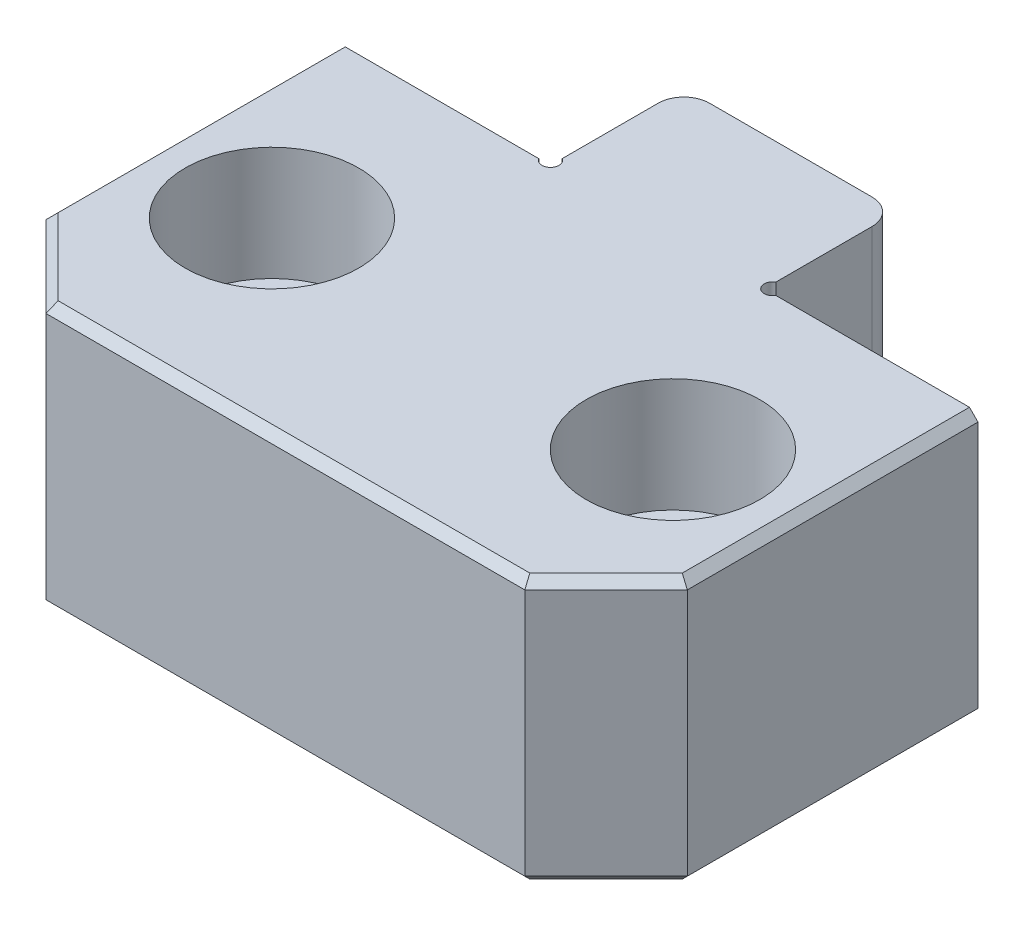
ISO-10303-21;
HEADER;
FILE_DESCRIPTION(('STEP AP214'),'2;1');
FILE_NAME('part.step','',(''),(''),'','','');
FILE_SCHEMA(('AUTOMOTIVE_DESIGN { 1 0 10303 214 1 1 1 1 }'));
ENDSEC;
DATA;
#1=APPLICATION_CONTEXT('core data for automotive mechanical design processes');
#2=APPLICATION_PROTOCOL_DEFINITION('international standard','automotive_design',2000,#1);
#3=PRODUCT_CONTEXT('',#1,'mechanical');
#4=PRODUCT('Part','Part','',(#3));
#5=PRODUCT_RELATED_PRODUCT_CATEGORY('part','',(#4));
#6=PRODUCT_DEFINITION_FORMATION('','',#4);
#7=PRODUCT_DEFINITION_CONTEXT('part definition',#1,'design');
#8=PRODUCT_DEFINITION('design','',#6,#7);
#9=PRODUCT_DEFINITION_SHAPE('','',#8);
#10=(LENGTH_UNIT() NAMED_UNIT(*) SI_UNIT(.MILLI.,.METRE.));
#11=(NAMED_UNIT(*) PLANE_ANGLE_UNIT() SI_UNIT($,.RADIAN.));
#12=(NAMED_UNIT(*) SI_UNIT($,.STERADIAN.) SOLID_ANGLE_UNIT());
#13=UNCERTAINTY_MEASURE_WITH_UNIT(LENGTH_MEASURE(1.E-05),#10,'distance_accuracy_value','');
#14=(GEOMETRIC_REPRESENTATION_CONTEXT(3) GLOBAL_UNCERTAINTY_ASSIGNED_CONTEXT((#13)) GLOBAL_UNIT_ASSIGNED_CONTEXT((#10,
#11,#12)) REPRESENTATION_CONTEXT('',''));
#15=CARTESIAN_POINT('',(0.,0.,0.));
#16=DIRECTION('',(0.,0.,1.));
#17=DIRECTION('',(1.,0.,0.));
#18=AXIS2_PLACEMENT_3D('',#15,#16,#17);
#19=CARTESIAN_POINT('',(-11.9126,15.748,10.9855));
#20=DIRECTION('',(0.,-1.,0.));
#21=DIRECTION('',(0.,0.,-1.));
#22=AXIS2_PLACEMENT_3D('',#19,#20,#21);
#23=CYLINDRICAL_SURFACE('',#22,3.5687);
#24=CARTESIAN_POINT('',(-11.9126,0.,10.9855));
#25=DIRECTION('',(0.,-1.,0.));
#26=DIRECTION('',(0.,0.,-1.));
#27=AXIS2_PLACEMENT_3D('',#24,#25,#26);
#28=CIRCLE('',#27,3.5687);
#29=CARTESIAN_POINT('',(-11.9126,0.,7.4168));
#30=VERTEX_POINT('',#29);
#31=EDGE_CURVE('E321',#30,#30,#28,.T.);
#32=ORIENTED_EDGE('',*,*,#31,.T.);
#33=EDGE_LOOP('',(#32));
#34=FACE_BOUND('',#33,.T.);
#35=CARTESIAN_POINT('',(-11.9126,8.9916,10.9855));
#36=DIRECTION('',(0.,1.,0.));
#37=DIRECTION('',(0.,0.,1.));
#38=AXIS2_PLACEMENT_3D('',#35,#36,#37);
#39=CIRCLE('',#38,3.5687);
#40=CARTESIAN_POINT('',(-11.9126,8.9916,14.5542));
#41=VERTEX_POINT('',#40);
#42=EDGE_CURVE('E335',#41,#41,#39,.F.);
#43=ORIENTED_EDGE('',*,*,#42,.F.);
#44=EDGE_LOOP('',(#43));
#45=FACE_BOUND('',#44,.T.);
#46=ADVANCED_FACE('F32',(#34,#45),#23,.F.);
#47=CARTESIAN_POINT('',(11.9126,15.748,10.9855));
#48=DIRECTION('',(0.,-1.,0.));
#49=DIRECTION('',(0.,0.,-1.));
#50=AXIS2_PLACEMENT_3D('',#47,#48,#49);
#51=CYLINDRICAL_SURFACE('',#50,3.5687);
#52=CARTESIAN_POINT('',(11.9126,0.,10.9855));
#53=DIRECTION('',(0.,-1.,0.));
#54=DIRECTION('',(0.,0.,-1.));
#55=AXIS2_PLACEMENT_3D('',#52,#53,#54);
#56=CIRCLE('',#55,3.5687);
#57=CARTESIAN_POINT('',(11.9126,0.,7.4168));
#58=VERTEX_POINT('',#57);
#59=EDGE_CURVE('E211',#58,#58,#56,.T.);
#60=ORIENTED_EDGE('',*,*,#59,.T.);
#61=EDGE_LOOP('',(#60));
#62=FACE_BOUND('',#61,.T.);
#63=CARTESIAN_POINT('',(11.9126,8.9916,10.9855));
#64=DIRECTION('',(0.,1.,0.));
#65=DIRECTION('',(0.,0.,1.));
#66=AXIS2_PLACEMENT_3D('',#63,#64,#65);
#67=CIRCLE('',#66,3.5687);
#68=CARTESIAN_POINT('',(11.9126,8.9916,14.5542));
#69=VERTEX_POINT('',#68);
#70=EDGE_CURVE('E325',#69,#69,#67,.F.);
#71=ORIENTED_EDGE('',*,*,#70,.F.);
#72=EDGE_LOOP('',(#71));
#73=FACE_BOUND('',#72,.T.);
#74=ADVANCED_FACE('F478',(#62,#73),#51,.F.);
#75=CARTESIAN_POINT('',(-19.05,15.748,22.098));
#76=DIRECTION('',(1.,0.,0.));
#77=DIRECTION('',(0.,0.,-1.));
#78=AXIS2_PLACEMENT_3D('',#75,#76,#77);
#79=PLANE('',#78);
#80=DIRECTION('',(0.,1.,0.));
#81=VECTOR('',#80,1.);
#82=CARTESIAN_POINT('',(-19.05,15.748,17.272));
#83=LINE('',#82,#81);
#84=CARTESIAN_POINT('',(-19.05,0.507999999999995,17.272));
#85=VERTEX_POINT('',#84);
#86=CARTESIAN_POINT('',(-19.05,15.24,17.272));
#87=VERTEX_POINT('',#86);
#88=EDGE_CURVE('E244',#85,#87,#83,.T.);
#89=ORIENTED_EDGE('',*,*,#88,.T.);
#90=DIRECTION('',(0.,0.,-1.));
#91=VECTOR('',#90,1.);
#92=CARTESIAN_POINT('',(-19.05,15.24,0.));
#93=LINE('',#92,#91);
#94=CARTESIAN_POINT('',(-19.05,15.24,0.));
#95=VERTEX_POINT('',#94);
#96=EDGE_CURVE('E275',#87,#95,#93,.T.);
#97=ORIENTED_EDGE('',*,*,#96,.T.);
#98=DIRECTION('',(0.,-1.,0.));
#99=VECTOR('',#98,1.);
#100=CARTESIAN_POINT('',(-19.05,15.748,0.));
#101=LINE('',#100,#99);
#102=CARTESIAN_POINT('',(-19.05,0.507999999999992,0.));
#103=VERTEX_POINT('',#102);
#104=EDGE_CURVE('E218',#95,#103,#101,.T.);
#105=ORIENTED_EDGE('',*,*,#104,.T.);
#106=DIRECTION('',(0.,0.,1.));
#107=VECTOR('',#106,1.);
#108=CARTESIAN_POINT('',(-19.05,0.507999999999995,22.098));
#109=LINE('',#108,#107);
#110=EDGE_CURVE('E272',#103,#85,#109,.T.);
#111=ORIENTED_EDGE('',*,*,#110,.T.);
#112=EDGE_LOOP('',(#89,#97,#105,#111));
#113=FACE_BOUND('',#112,.T.);
#114=ADVANCED_FACE('F462',(#113),#79,.F.);
#115=CARTESIAN_POINT('',(-19.05,15.748,22.098));
#116=DIRECTION('',(0.,0.,-1.));
#117=DIRECTION('',(-1.,0.,0.));
#118=AXIS2_PLACEMENT_3D('',#115,#116,#117);
#119=PLANE('',#118);
#120=DIRECTION('',(0.,1.,0.));
#121=VECTOR('',#120,1.);
#122=CARTESIAN_POINT('',(14.224,15.748,22.098));
#123=LINE('',#122,#121);
#124=CARTESIAN_POINT('',(14.224,0.507999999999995,22.098));
#125=VERTEX_POINT('',#124);
#126=CARTESIAN_POINT('',(14.224,15.24,22.098));
#127=VERTEX_POINT('',#126);
#128=EDGE_CURVE('E241',#125,#127,#123,.T.);
#129=ORIENTED_EDGE('',*,*,#128,.T.);
#130=DIRECTION('',(-1.,0.,0.));
#131=VECTOR('',#130,1.);
#132=CARTESIAN_POINT('',(-14.224,15.24,22.098));
#133=LINE('',#132,#131);
#134=CARTESIAN_POINT('',(-14.224,15.24,22.098));
#135=VERTEX_POINT('',#134);
#136=EDGE_CURVE('E299',#127,#135,#133,.T.);
#137=ORIENTED_EDGE('',*,*,#136,.T.);
#138=DIRECTION('',(0.,-1.,0.));
#139=VECTOR('',#138,1.);
#140=CARTESIAN_POINT('',(-14.224,15.748,22.098));
#141=LINE('',#140,#139);
#142=CARTESIAN_POINT('',(-14.224,0.507999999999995,22.098));
#143=VERTEX_POINT('',#142);
#144=EDGE_CURVE('E238',#135,#143,#141,.T.);
#145=ORIENTED_EDGE('',*,*,#144,.T.);
#146=DIRECTION('',(1.,0.,0.));
#147=VECTOR('',#146,1.);
#148=CARTESIAN_POINT('',(-19.05,0.507999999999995,22.098));
#149=LINE('',#148,#147);
#150=EDGE_CURVE('E297',#143,#125,#149,.T.);
#151=ORIENTED_EDGE('',*,*,#150,.T.);
#152=EDGE_LOOP('',(#129,#137,#145,#151));
#153=FACE_BOUND('',#152,.T.);
#154=ADVANCED_FACE('F466',(#153),#119,.F.);
#155=CARTESIAN_POINT('',(19.05,15.748,22.098));
#156=DIRECTION('',(-1.,0.,0.));
#157=DIRECTION('',(0.,0.,1.));
#158=AXIS2_PLACEMENT_3D('',#155,#156,#157);
#159=PLANE('',#158);
#160=DIRECTION('',(0.,-1.,0.));
#161=VECTOR('',#160,1.);
#162=CARTESIAN_POINT('',(19.05,15.748,0.));
#163=LINE('',#162,#161);
#164=CARTESIAN_POINT('',(19.05,15.24,0.));
#165=VERTEX_POINT('',#164);
#166=CARTESIAN_POINT('',(19.05,0.507999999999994,0.));
#167=VERTEX_POINT('',#166);
#168=EDGE_CURVE('E232',#165,#167,#163,.T.);
#169=ORIENTED_EDGE('',*,*,#168,.F.);
#170=DIRECTION('',(0.,0.,1.));
#171=VECTOR('',#170,1.);
#172=CARTESIAN_POINT('',(19.05,15.24,17.272));
#173=LINE('',#172,#171);
#174=CARTESIAN_POINT('',(19.05,15.24,17.272));
#175=VERTEX_POINT('',#174);
#176=EDGE_CURVE('E291',#165,#175,#173,.T.);
#177=ORIENTED_EDGE('',*,*,#176,.T.);
#178=DIRECTION('',(0.,-1.,0.));
#179=VECTOR('',#178,1.);
#180=CARTESIAN_POINT('',(19.05,15.748,17.272));
#181=LINE('',#180,#179);
#182=CARTESIAN_POINT('',(19.05,0.507999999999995,17.272));
#183=VERTEX_POINT('',#182);
#184=EDGE_CURVE('E235',#175,#183,#181,.T.);
#185=ORIENTED_EDGE('',*,*,#184,.T.);
#186=DIRECTION('',(0.,0.,-1.));
#187=VECTOR('',#186,1.);
#188=CARTESIAN_POINT('',(19.05,0.507999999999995,22.098));
#189=LINE('',#188,#187);
#190=EDGE_CURVE('E289',#183,#167,#189,.T.);
#191=ORIENTED_EDGE('',*,*,#190,.T.);
#192=EDGE_LOOP('',(#169,#177,#185,#191));
#193=FACE_BOUND('',#192,.T.);
#194=ADVANCED_FACE('F408',(#193),#159,.F.);
#195=CARTESIAN_POINT('',(7.0439409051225,15.748,0.));
#196=DIRECTION('',(0.,0.,1.));
#197=DIRECTION('',(1.,0.,0.));
#198=AXIS2_PLACEMENT_3D('',#195,#196,#197);
#199=PLANE('',#198);
#200=DIRECTION('',(-1.,0.,0.));
#201=VECTOR('',#200,1.);
#202=CARTESIAN_POINT('',(7.0439409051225,15.748,0.));
#203=LINE('',#202,#201);
#204=CARTESIAN_POINT('',(18.542,15.748,0.));
#205=VERTEX_POINT('',#204);
#206=CARTESIAN_POINT('',(7.0439409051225,15.748,0.));
#207=VERTEX_POINT('',#206);
#208=EDGE_CURVE('E217',#205,#207,#203,.T.);
#209=ORIENTED_EDGE('',*,*,#208,.F.);
#210=DIRECTION('',(0.707106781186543,-0.707106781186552,0.));
#211=VECTOR('',#210,1.);
#212=CARTESIAN_POINT('',(18.542,15.748,0.));
#213=LINE('',#212,#211);
#214=EDGE_CURVE('E287',#205,#165,#213,.T.);
#215=ORIENTED_EDGE('',*,*,#214,.T.);
#216=ORIENTED_EDGE('',*,*,#168,.T.);
#217=DIRECTION('',(0.707106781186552,0.707106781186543,0.));
#218=VECTOR('',#217,1.);
#219=CARTESIAN_POINT('',(19.05,0.507999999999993,0.));
#220=LINE('',#219,#218);
#221=CARTESIAN_POINT('',(18.542,0.,0.));
#222=VERTEX_POINT('',#221);
#223=EDGE_CURVE('E285',#167,#222,#220,.F.);
#224=ORIENTED_EDGE('',*,*,#223,.T.);
#225=DIRECTION('',(-1.,0.,0.));
#226=VECTOR('',#225,1.);
#227=CARTESIAN_POINT('',(7.0439409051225,0.,0.));
#228=LINE('',#227,#226);
#229=CARTESIAN_POINT('',(7.0439409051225,0.,0.));
#230=VERTEX_POINT('',#229);
#231=EDGE_CURVE('E207',#222,#230,#228,.T.);
#232=ORIENTED_EDGE('',*,*,#231,.T.);
#233=DIRECTION('',(0.,-1.,0.));
#234=VECTOR('',#233,1.);
#235=CARTESIAN_POINT('',(7.0439409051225,15.748,0.));
#236=LINE('',#235,#234);
#237=EDGE_CURVE('E206',#207,#230,#236,.T.);
#238=ORIENTED_EDGE('',*,*,#237,.F.);
#239=EDGE_LOOP('',(#209,#215,#216,#224,#232,#238));
#240=FACE_BOUND('',#239,.T.);
#241=ADVANCED_FACE('F405',(#240),#199,.F.);
#242=CARTESIAN_POINT('',(6.604,15.748,-0.254));
#243=DIRECTION('',(0.,-1.,0.));
#244=DIRECTION('',(0.,0.,-1.));
#245=AXIS2_PLACEMENT_3D('',#242,#243,#244);
#246=CYLINDRICAL_SURFACE('',#245,0.508);
#247=CARTESIAN_POINT('',(6.604,0.,-0.254));
#248=DIRECTION('',(0.,-1.,0.));
#249=DIRECTION('',(0.,0.,1.));
#250=AXIS2_PLACEMENT_3D('',#247,#248,#249);
#251=CIRCLE('',#250,0.508);
#252=CARTESIAN_POINT('',(6.16405909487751,0.,0.));
#253=VERTEX_POINT('',#252);
#254=EDGE_CURVE('E197',#230,#253,#251,.T.);
#255=ORIENTED_EDGE('',*,*,#254,.T.);
#256=DIRECTION('',(0.,-1.,0.));
#257=VECTOR('',#256,1.);
#258=CARTESIAN_POINT('',(6.16405909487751,15.748,0.));
#259=LINE('',#258,#257);
#260=CARTESIAN_POINT('',(6.16405909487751,0.254000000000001,0.));
#261=VERTEX_POINT('',#260);
#262=EDGE_CURVE('E180',#253,#261,#259,.F.);
#263=ORIENTED_EDGE('',*,*,#262,.T.);
#264=CARTESIAN_POINT('',(6.604,0.254000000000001,-0.254));
#265=DIRECTION('',(0.,1.,0.));
#266=DIRECTION('',(0.,0.,1.));
#267=AXIS2_PLACEMENT_3D('',#264,#265,#266);
#268=CIRCLE('',#267,0.508);
#269=CARTESIAN_POINT('',(6.35,0.254,-0.693940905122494));
#270=VERTEX_POINT('',#269);
#271=EDGE_CURVE('E564',#261,#270,#268,.F.);
#272=ORIENTED_EDGE('',*,*,#271,.T.);
#273=DIRECTION('',(0.,-1.,0.));
#274=VECTOR('',#273,1.);
#275=CARTESIAN_POINT('',(6.35,15.748,-0.693940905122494));
#276=LINE('',#275,#274);
#277=CARTESIAN_POINT('',(6.35,15.748,-0.693940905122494));
#278=VERTEX_POINT('',#277);
#279=EDGE_CURVE('E228',#278,#270,#276,.T.);
#280=ORIENTED_EDGE('',*,*,#279,.F.);
#281=CARTESIAN_POINT('',(6.604,15.748,-0.254));
#282=DIRECTION('',(0.,-1.,0.));
#283=DIRECTION('',(0.,0.,1.));
#284=AXIS2_PLACEMENT_3D('',#281,#282,#283);
#285=CIRCLE('',#284,0.508);
#286=EDGE_CURVE('E358',#207,#278,#285,.T.);
#287=ORIENTED_EDGE('',*,*,#286,.F.);
#288=ORIENTED_EDGE('',*,*,#237,.T.);
#289=EDGE_LOOP('',(#255,#263,#272,#280,#287,#288));
#290=FACE_BOUND('',#289,.T.);
#291=ADVANCED_FACE('F203',(#290),#246,.F.);
#292=CARTESIAN_POINT('',(6.35,15.748,-7.9248));
#293=DIRECTION('',(-1.,0.,0.));
#294=DIRECTION('',(0.,0.,1.));
#295=AXIS2_PLACEMENT_3D('',#292,#293,#294);
#296=PLANE('',#295);
#297=ORIENTED_EDGE('',*,*,#279,.T.);
#298=DIRECTION('',(0.,0.,1.));
#299=VECTOR('',#298,1.);
#300=CARTESIAN_POINT('',(6.35,0.254,0.));
#301=LINE('',#300,#299);
#302=CARTESIAN_POINT('',(6.35,0.254000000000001,-6.4008));
#303=VERTEX_POINT('',#302);
#304=EDGE_CURVE('E200',#303,#270,#301,.T.);
#305=ORIENTED_EDGE('',*,*,#304,.F.);
#306=DIRECTION('',(0.,-1.,0.));
#307=VECTOR('',#306,1.);
#308=CARTESIAN_POINT('',(6.35,15.748,-6.4008));
#309=LINE('',#308,#307);
#310=CARTESIAN_POINT('',(6.35,15.748,-6.4008));
#311=VERTEX_POINT('',#310);
#312=EDGE_CURVE('E259',#303,#311,#309,.F.);
#313=ORIENTED_EDGE('',*,*,#312,.T.);
#314=DIRECTION('',(0.,0.,-1.));
#315=VECTOR('',#314,1.);
#316=CARTESIAN_POINT('',(6.35,15.748,-7.9248));
#317=LINE('',#316,#315);
#318=EDGE_CURVE('E360',#278,#311,#317,.T.);
#319=ORIENTED_EDGE('',*,*,#318,.F.);
#320=EDGE_LOOP('',(#297,#305,#313,#319));
#321=FACE_BOUND('',#320,.T.);
#322=ADVANCED_FACE('F506',(#321),#296,.F.);
#323=CARTESIAN_POINT('',(-6.35,15.748,-7.9248));
#324=DIRECTION('',(0.,0.,1.));
#325=DIRECTION('',(1.,0.,0.));
#326=AXIS2_PLACEMENT_3D('',#323,#324,#325);
#327=PLANE('',#326);
#328=DIRECTION('',(0.,-1.,0.));
#329=VECTOR('',#328,1.);
#330=CARTESIAN_POINT('',(4.826,15.748,-7.9248));
#331=LINE('',#330,#329);
#332=CARTESIAN_POINT('',(4.826,15.748,-7.9248));
#333=VERTEX_POINT('',#332);
#334=CARTESIAN_POINT('',(4.826,0.254000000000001,-7.9248));
#335=VERTEX_POINT('',#334);
#336=EDGE_CURVE('E250',#333,#335,#331,.T.);
#337=ORIENTED_EDGE('',*,*,#336,.T.);
#338=DIRECTION('',(1.,0.,0.));
#339=VECTOR('',#338,1.);
#340=CARTESIAN_POINT('',(6.35,0.254,-7.9248));
#341=LINE('',#340,#339);
#342=CARTESIAN_POINT('',(-4.826,0.254000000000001,-7.9248));
#343=VERTEX_POINT('',#342);
#344=EDGE_CURVE('E46',#343,#335,#341,.T.);
#345=ORIENTED_EDGE('',*,*,#344,.F.);
#346=DIRECTION('',(0.,-1.,0.));
#347=VECTOR('',#346,1.);
#348=CARTESIAN_POINT('',(-4.826,15.748,-7.9248));
#349=LINE('',#348,#347);
#350=CARTESIAN_POINT('',(-4.826,15.748,-7.9248));
#351=VERTEX_POINT('',#350);
#352=EDGE_CURVE('E253',#343,#351,#349,.F.);
#353=ORIENTED_EDGE('',*,*,#352,.T.);
#354=DIRECTION('',(-1.,0.,0.));
#355=VECTOR('',#354,1.);
#356=CARTESIAN_POINT('',(-6.35,15.748,-7.9248));
#357=LINE('',#356,#355);
#358=EDGE_CURVE('E363',#333,#351,#357,.T.);
#359=ORIENTED_EDGE('',*,*,#358,.F.);
#360=EDGE_LOOP('',(#337,#345,#353,#359));
#361=FACE_BOUND('',#360,.T.);
#362=ADVANCED_FACE('F431',(#361),#327,.F.);
#363=CARTESIAN_POINT('',(-6.35,15.748,-0.693940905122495));
#364=DIRECTION('',(1.,0.,0.));
#365=DIRECTION('',(0.,0.,-1.));
#366=AXIS2_PLACEMENT_3D('',#363,#364,#365);
#367=PLANE('',#366);
#368=DIRECTION('',(0.,-1.,0.));
#369=VECTOR('',#368,1.);
#370=CARTESIAN_POINT('',(-6.35,15.748,-6.4008));
#371=LINE('',#370,#369);
#372=CARTESIAN_POINT('',(-6.35,15.748,-6.4008));
#373=VERTEX_POINT('',#372);
#374=CARTESIAN_POINT('',(-6.35,0.254000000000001,-6.4008));
#375=VERTEX_POINT('',#374);
#376=EDGE_CURVE('E247',#373,#375,#371,.T.);
#377=ORIENTED_EDGE('',*,*,#376,.T.);
#378=DIRECTION('',(0.,0.,-1.));
#379=VECTOR('',#378,1.);
#380=CARTESIAN_POINT('',(-6.35,0.254,-7.9248));
#381=LINE('',#380,#379);
#382=CARTESIAN_POINT('',(-6.35,0.254000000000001,-0.693940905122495));
#383=VERTEX_POINT('',#382);
#384=EDGE_CURVE('E444',#383,#375,#381,.T.);
#385=ORIENTED_EDGE('',*,*,#384,.F.);
#386=DIRECTION('',(0.,-1.,0.));
#387=VECTOR('',#386,1.);
#388=CARTESIAN_POINT('',(-6.35,15.748,-0.693940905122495));
#389=LINE('',#388,#387);
#390=CARTESIAN_POINT('',(-6.35,15.748,-0.693940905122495));
#391=VERTEX_POINT('',#390);
#392=EDGE_CURVE('E225',#391,#383,#389,.T.);
#393=ORIENTED_EDGE('',*,*,#392,.F.);
#394=DIRECTION('',(0.,0.,1.));
#395=VECTOR('',#394,1.);
#396=CARTESIAN_POINT('',(-6.35,15.748,-0.693940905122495));
#397=LINE('',#396,#395);
#398=EDGE_CURVE('E366',#373,#391,#397,.T.);
#399=ORIENTED_EDGE('',*,*,#398,.F.);
#400=EDGE_LOOP('',(#377,#385,#393,#399));
#401=FACE_BOUND('',#400,.T.);
#402=ADVANCED_FACE('F442',(#401),#367,.F.);
#403=CARTESIAN_POINT('',(-6.604,15.748,-0.254));
#404=DIRECTION('',(0.,-1.,0.));
#405=DIRECTION('',(0.,0.,-1.));
#406=AXIS2_PLACEMENT_3D('',#403,#404,#405);
#407=CYLINDRICAL_SURFACE('',#406,0.508);
#408=CARTESIAN_POINT('',(-6.604,0.254000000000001,-0.254));
#409=DIRECTION('',(0.,1.,0.));
#410=DIRECTION('',(0.,0.,1.));
#411=AXIS2_PLACEMENT_3D('',#408,#409,#410);
#412=CIRCLE('',#411,0.508);
#413=CARTESIAN_POINT('',(-6.1640590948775,0.254000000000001,0.));
#414=VERTEX_POINT('',#413);
#415=EDGE_CURVE('E563',#383,#414,#412,.F.);
#416=ORIENTED_EDGE('',*,*,#415,.T.);
#417=DIRECTION('',(0.,-1.,0.));
#418=VECTOR('',#417,1.);
#419=CARTESIAN_POINT('',(-6.1640590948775,15.748,0.));
#420=LINE('',#419,#418);
#421=CARTESIAN_POINT('',(-6.1640590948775,0.,0.));
#422=VERTEX_POINT('',#421);
#423=EDGE_CURVE('E191',#414,#422,#420,.T.);
#424=ORIENTED_EDGE('',*,*,#423,.T.);
#425=CARTESIAN_POINT('',(-6.604,0.,-0.254));
#426=DIRECTION('',(0.,-1.,0.));
#427=DIRECTION('',(0.,0.,1.));
#428=AXIS2_PLACEMENT_3D('',#425,#426,#427);
#429=CIRCLE('',#428,0.508);
#430=CARTESIAN_POINT('',(-7.04394090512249,0.,0.));
#431=VERTEX_POINT('',#430);
#432=EDGE_CURVE('E199',#422,#431,#429,.T.);
#433=ORIENTED_EDGE('',*,*,#432,.T.);
#434=DIRECTION('',(0.,-1.,0.));
#435=VECTOR('',#434,1.);
#436=CARTESIAN_POINT('',(-7.04394090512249,15.748,0.));
#437=LINE('',#436,#435);
#438=CARTESIAN_POINT('',(-7.04394090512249,15.748,0.));
#439=VERTEX_POINT('',#438);
#440=EDGE_CURVE('E221',#439,#431,#437,.T.);
#441=ORIENTED_EDGE('',*,*,#440,.F.);
#442=CARTESIAN_POINT('',(-6.604,15.748,-0.254));
#443=DIRECTION('',(0.,-1.,0.));
#444=DIRECTION('',(0.,0.,1.));
#445=AXIS2_PLACEMENT_3D('',#442,#443,#444);
#446=CIRCLE('',#445,0.508);
#447=EDGE_CURVE('E368',#391,#439,#446,.T.);
#448=ORIENTED_EDGE('',*,*,#447,.F.);
#449=ORIENTED_EDGE('',*,*,#392,.T.);
#450=EDGE_LOOP('',(#416,#424,#433,#441,#448,#449));
#451=FACE_BOUND('',#450,.T.);
#452=ADVANCED_FACE('F447',(#451),#407,.F.);
#453=CARTESIAN_POINT('',(-19.05,15.748,0.));
#454=DIRECTION('',(0.,0.,1.));
#455=DIRECTION('',(1.,0.,0.));
#456=AXIS2_PLACEMENT_3D('',#453,#454,#455);
#457=PLANE('',#456);
#458=ORIENTED_EDGE('',*,*,#104,.F.);
#459=DIRECTION('',(0.707106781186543,0.707106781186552,0.));
#460=VECTOR('',#459,1.);
#461=CARTESIAN_POINT('',(-18.542,15.748,0.));
#462=LINE('',#461,#460);
#463=CARTESIAN_POINT('',(-18.542,15.748,0.));
#464=VERTEX_POINT('',#463);
#465=EDGE_CURVE('E279',#95,#464,#462,.T.);
#466=ORIENTED_EDGE('',*,*,#465,.T.);
#467=DIRECTION('',(-1.,0.,0.));
#468=VECTOR('',#467,1.);
#469=CARTESIAN_POINT('',(-19.05,15.748,0.));
#470=LINE('',#469,#468);
#471=EDGE_CURVE('E222',#439,#464,#470,.T.);
#472=ORIENTED_EDGE('',*,*,#471,.F.);
#473=ORIENTED_EDGE('',*,*,#440,.T.);
#474=DIRECTION('',(-1.,0.,0.));
#475=VECTOR('',#474,1.);
#476=CARTESIAN_POINT('',(-19.05,0.,0.));
#477=LINE('',#476,#475);
#478=CARTESIAN_POINT('',(-18.542,0.,0.));
#479=VERTEX_POINT('',#478);
#480=EDGE_CURVE('E209',#431,#479,#477,.T.);
#481=ORIENTED_EDGE('',*,*,#480,.T.);
#482=DIRECTION('',(0.707106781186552,-0.707106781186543,0.));
#483=VECTOR('',#482,1.);
#484=CARTESIAN_POINT('',(-19.05,0.507999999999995,0.));
#485=LINE('',#484,#483);
#486=EDGE_CURVE('E277',#479,#103,#485,.F.);
#487=ORIENTED_EDGE('',*,*,#486,.T.);
#488=EDGE_LOOP('',(#458,#466,#472,#473,#481,#487));
#489=FACE_BOUND('',#488,.T.);
#490=ADVANCED_FACE('F449',(#489),#457,.F.);
#491=CARTESIAN_POINT('',(-6.604,15.748,-0.254));
#492=DIRECTION('',(0.,1.,0.));
#493=DIRECTION('',(0.,0.,1.));
#494=AXIS2_PLACEMENT_3D('',#491,#492,#493);
#495=PLANE('',#494);
#496=CARTESIAN_POINT('',(-11.9126,15.748,10.9855));
#497=DIRECTION('',(0.,1.,0.));
#498=DIRECTION('',(0.,0.,1.));
#499=AXIS2_PLACEMENT_3D('',#496,#497,#498);
#500=CIRCLE('',#499,5.1562);
#501=CARTESIAN_POINT('',(-11.9126,15.748,16.1417));
#502=VERTEX_POINT('',#501);
#503=EDGE_CURVE('E190',#502,#502,#500,.T.);
#504=ORIENTED_EDGE('',*,*,#503,.F.);
#505=EDGE_LOOP('',(#504));
#506=FACE_BOUND('',#505,.T.);
#507=CARTESIAN_POINT('',(11.9126,15.748,10.9855));
#508=DIRECTION('',(0.,1.,0.));
#509=DIRECTION('',(0.,0.,1.));
#510=AXIS2_PLACEMENT_3D('',#507,#508,#509);
#511=CIRCLE('',#510,5.1562);
#512=CARTESIAN_POINT('',(11.9126,15.748,16.1417));
#513=VERTEX_POINT('',#512);
#514=EDGE_CURVE('E337',#513,#513,#511,.T.);
#515=ORIENTED_EDGE('',*,*,#514,.F.);
#516=EDGE_LOOP('',(#515));
#517=FACE_BOUND('',#516,.T.);
#518=ORIENTED_EDGE('',*,*,#471,.T.);
#519=DIRECTION('',(0.,0.,1.));
#520=VECTOR('',#519,1.);
#521=CARTESIAN_POINT('',(-18.542,15.748,17.272));
#522=LINE('',#521,#520);
#523=CARTESIAN_POINT('',(-18.542,15.748,17.0615795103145));
#524=VERTEX_POINT('',#523);
#525=EDGE_CURVE('E269',#464,#524,#522,.T.);
#526=ORIENTED_EDGE('',*,*,#525,.T.);
#527=DIRECTION('',(0.707106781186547,0.,0.707106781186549));
#528=VECTOR('',#527,1.);
#529=CARTESIAN_POINT('',(-21.2307897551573,15.748,14.3727897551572));
#530=LINE('',#529,#528);
#531=CARTESIAN_POINT('',(-14.0135795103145,15.748,21.59));
#532=VERTEX_POINT('',#531);
#533=EDGE_CURVE('E267',#524,#532,#530,.T.);
#534=ORIENTED_EDGE('',*,*,#533,.T.);
#535=DIRECTION('',(1.,0.,0.));
#536=VECTOR('',#535,1.);
#537=CARTESIAN_POINT('',(14.224,15.748,21.59));
#538=LINE('',#537,#536);
#539=CARTESIAN_POINT('',(14.0135795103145,15.748,21.59));
#540=VERTEX_POINT('',#539);
#541=EDGE_CURVE('E261',#532,#540,#538,.T.);
#542=ORIENTED_EDGE('',*,*,#541,.T.);
#543=DIRECTION('',(0.707106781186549,0.,-0.707106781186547));
#544=VECTOR('',#543,1.);
#545=CARTESIAN_POINT('',(14.6267897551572,15.748,20.9767897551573));
#546=LINE('',#545,#544);
#547=CARTESIAN_POINT('',(18.542,15.748,17.0615795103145));
#548=VERTEX_POINT('',#547);
#549=EDGE_CURVE('E263',#540,#548,#546,.T.);
#550=ORIENTED_EDGE('',*,*,#549,.T.);
#551=DIRECTION('',(0.,0.,-1.));
#552=VECTOR('',#551,1.);
#553=CARTESIAN_POINT('',(18.542,15.748,0.));
#554=LINE('',#553,#552);
#555=EDGE_CURVE('E265',#548,#205,#554,.T.);
#556=ORIENTED_EDGE('',*,*,#555,.T.);
#557=ORIENTED_EDGE('',*,*,#208,.T.);
#558=ORIENTED_EDGE('',*,*,#286,.T.);
#559=ORIENTED_EDGE('',*,*,#318,.T.);
#560=CARTESIAN_POINT('',(4.826,15.748,-6.4008));
#561=DIRECTION('',(0.,1.,0.));
#562=DIRECTION('',(0.,0.,1.));
#563=AXIS2_PLACEMENT_3D('',#560,#561,#562);
#564=CIRCLE('',#563,1.524);
#565=EDGE_CURVE('E255',#311,#333,#564,.T.);
#566=ORIENTED_EDGE('',*,*,#565,.T.);
#567=ORIENTED_EDGE('',*,*,#358,.T.);
#568=CARTESIAN_POINT('',(-4.826,15.748,-6.4008));
#569=DIRECTION('',(0.,1.,0.));
#570=DIRECTION('',(0.,0.,1.));
#571=AXIS2_PLACEMENT_3D('',#568,#569,#570);
#572=CIRCLE('',#571,1.524);
#573=EDGE_CURVE('E257',#351,#373,#572,.T.);
#574=ORIENTED_EDGE('',*,*,#573,.T.);
#575=ORIENTED_EDGE('',*,*,#398,.T.);
#576=ORIENTED_EDGE('',*,*,#447,.T.);
#577=EDGE_LOOP('',(#518,#526,#534,#542,#550,#556,#557,#558,#559,#566,#567,#574,#575,#576));
#578=FACE_BOUND('',#577,.T.);
#579=ADVANCED_FACE('F373',(#506,#517,#578),#495,.T.);
#580=CARTESIAN_POINT('',(-6.604,0.,-0.254));
#581=DIRECTION('',(0.,1.,0.));
#582=DIRECTION('',(0.,0.,1.));
#583=AXIS2_PLACEMENT_3D('',#580,#581,#582);
#584=PLANE('',#583);
#585=ORIENTED_EDGE('',*,*,#31,.F.);
#586=EDGE_LOOP('',(#585));
#587=FACE_BOUND('',#586,.T.);
#588=ORIENTED_EDGE('',*,*,#59,.F.);
#589=EDGE_LOOP('',(#588));
#590=FACE_BOUND('',#589,.T.);
#591=ORIENTED_EDGE('',*,*,#432,.F.);
#592=DIRECTION('',(-1.,0.,0.));
#593=VECTOR('',#592,1.);
#594=CARTESIAN_POINT('',(6.35,0.,0.));
#595=LINE('',#594,#593);
#596=EDGE_CURVE('E183',#253,#422,#595,.T.);
#597=ORIENTED_EDGE('',*,*,#596,.F.);
#598=ORIENTED_EDGE('',*,*,#254,.F.);
#599=ORIENTED_EDGE('',*,*,#231,.F.);
#600=DIRECTION('',(0.,0.,1.));
#601=VECTOR('',#600,1.);
#602=CARTESIAN_POINT('',(18.542,0.,-0.253999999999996));
#603=LINE('',#602,#601);
#604=CARTESIAN_POINT('',(18.542,0.,17.0615795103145));
#605=VERTEX_POINT('',#604);
#606=EDGE_CURVE('E301',#222,#605,#603,.T.);
#607=ORIENTED_EDGE('',*,*,#606,.T.);
#608=DIRECTION('',(-0.707106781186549,0.,0.707106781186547));
#609=VECTOR('',#608,1.);
#610=CARTESIAN_POINT('',(13.8647897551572,0.,21.7387897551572));
#611=LINE('',#610,#609);
#612=CARTESIAN_POINT('',(14.0135795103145,0.,21.59));
#613=VERTEX_POINT('',#612);
#614=EDGE_CURVE('E303',#605,#613,#611,.T.);
#615=ORIENTED_EDGE('',*,*,#614,.T.);
#616=DIRECTION('',(-1.,0.,0.));
#617=VECTOR('',#616,1.);
#618=CARTESIAN_POINT('',(-6.604,0.,21.59));
#619=LINE('',#618,#617);
#620=CARTESIAN_POINT('',(-14.0135795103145,0.,21.59));
#621=VERTEX_POINT('',#620);
#622=EDGE_CURVE('E305',#613,#621,#619,.T.);
#623=ORIENTED_EDGE('',*,*,#622,.T.);
#624=DIRECTION('',(-0.707106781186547,0.,-0.707106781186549));
#625=VECTOR('',#624,1.);
#626=CARTESIAN_POINT('',(-18.6907897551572,0.,16.9127897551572));
#627=LINE('',#626,#625);
#628=CARTESIAN_POINT('',(-18.542,0.,17.0615795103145));
#629=VERTEX_POINT('',#628);
#630=EDGE_CURVE('E54',#621,#629,#627,.T.);
#631=ORIENTED_EDGE('',*,*,#630,.T.);
#632=DIRECTION('',(0.,0.,-1.));
#633=VECTOR('',#632,1.);
#634=CARTESIAN_POINT('',(-18.542,0.,-0.254));
#635=LINE('',#634,#633);
#636=EDGE_CURVE('E40',#629,#479,#635,.T.);
#637=ORIENTED_EDGE('',*,*,#636,.T.);
#638=ORIENTED_EDGE('',*,*,#480,.F.);
#639=EDGE_LOOP('',(#591,#597,#598,#599,#607,#615,#623,#631,#637,#638));
#640=FACE_BOUND('',#639,.T.);
#641=ADVANCED_FACE('F195',(#587,#590,#640),#584,.F.);
#642=CARTESIAN_POINT('',(19.05,15.748,17.272));
#643=DIRECTION('',(-0.707106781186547,0.,-0.707106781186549));
#644=DIRECTION('',(-0.707106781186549,0.,0.707106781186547));
#645=AXIS2_PLACEMENT_3D('',#642,#643,#644);
#646=PLANE('',#645);
#647=ORIENTED_EDGE('',*,*,#184,.F.);
#648=DIRECTION('',(0.707106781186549,0.,-0.707106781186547));
#649=VECTOR('',#648,1.);
#650=CARTESIAN_POINT('',(19.05,15.24,17.272));
#651=LINE('',#650,#649);
#652=EDGE_CURVE('E295',#175,#127,#651,.F.);
#653=ORIENTED_EDGE('',*,*,#652,.T.);
#654=ORIENTED_EDGE('',*,*,#128,.F.);
#655=DIRECTION('',(-0.707106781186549,0.,0.707106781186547));
#656=VECTOR('',#655,1.);
#657=CARTESIAN_POINT('',(19.05,0.507999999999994,17.272));
#658=LINE('',#657,#656);
#659=EDGE_CURVE('E293',#125,#183,#658,.F.);
#660=ORIENTED_EDGE('',*,*,#659,.T.);
#661=EDGE_LOOP('',(#647,#653,#654,#660));
#662=FACE_BOUND('',#661,.T.);
#663=ADVANCED_FACE('F496',(#662),#646,.F.);
#664=CARTESIAN_POINT('',(-14.224,15.748,22.098));
#665=DIRECTION('',(0.707106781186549,0.,-0.707106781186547));
#666=DIRECTION('',(-0.707106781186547,0.,-0.707106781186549));
#667=AXIS2_PLACEMENT_3D('',#664,#665,#666);
#668=PLANE('',#667);
#669=ORIENTED_EDGE('',*,*,#144,.F.);
#670=DIRECTION('',(0.707106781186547,0.,0.707106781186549));
#671=VECTOR('',#670,1.);
#672=CARTESIAN_POINT('',(-14.224,15.24,22.098));
#673=LINE('',#672,#671);
#674=EDGE_CURVE('E283',#135,#87,#673,.F.);
#675=ORIENTED_EDGE('',*,*,#674,.T.);
#676=ORIENTED_EDGE('',*,*,#88,.F.);
#677=DIRECTION('',(-0.707106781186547,0.,-0.707106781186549));
#678=VECTOR('',#677,1.);
#679=CARTESIAN_POINT('',(-14.224,0.507999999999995,22.098));
#680=LINE('',#679,#678);
#681=EDGE_CURVE('E281',#85,#143,#680,.F.);
#682=ORIENTED_EDGE('',*,*,#681,.T.);
#683=EDGE_LOOP('',(#669,#675,#676,#682));
#684=FACE_BOUND('',#683,.T.);
#685=ADVANCED_FACE('F463',(#684),#668,.F.);
#686=CARTESIAN_POINT('',(-4.826,15.748,-6.4008));
#687=DIRECTION('',(0.,-1.,0.));
#688=DIRECTION('',(0.,0.,-1.));
#689=AXIS2_PLACEMENT_3D('',#686,#687,#688);
#690=CYLINDRICAL_SURFACE('',#689,1.524);
#691=CARTESIAN_POINT('',(-4.826,0.254000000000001,-6.4008));
#692=DIRECTION('',(0.,1.,0.));
#693=DIRECTION('',(0.,0.,1.));
#694=AXIS2_PLACEMENT_3D('',#691,#692,#693);
#695=CIRCLE('',#694,1.524);
#696=EDGE_CURVE('E439',#375,#343,#695,.F.);
#697=ORIENTED_EDGE('',*,*,#696,.F.);
#698=ORIENTED_EDGE('',*,*,#376,.F.);
#699=ORIENTED_EDGE('',*,*,#573,.F.);
#700=ORIENTED_EDGE('',*,*,#352,.F.);
#701=EDGE_LOOP('',(#697,#698,#699,#700));
#702=FACE_BOUND('',#701,.T.);
#703=ADVANCED_FACE('F438',(#702),#690,.T.);
#704=CARTESIAN_POINT('',(4.826,15.748,-6.4008));
#705=DIRECTION('',(0.,-1.,0.));
#706=DIRECTION('',(0.,0.,-1.));
#707=AXIS2_PLACEMENT_3D('',#704,#705,#706);
#708=CYLINDRICAL_SURFACE('',#707,1.524);
#709=CARTESIAN_POINT('',(4.826,0.254000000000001,-6.4008));
#710=DIRECTION('',(0.,1.,0.));
#711=DIRECTION('',(0.,0.,1.));
#712=AXIS2_PLACEMENT_3D('',#709,#710,#711);
#713=CIRCLE('',#712,1.524);
#714=EDGE_CURVE('E11',#335,#303,#713,.F.);
#715=ORIENTED_EDGE('',*,*,#714,.F.);
#716=ORIENTED_EDGE('',*,*,#336,.F.);
#717=ORIENTED_EDGE('',*,*,#565,.F.);
#718=ORIENTED_EDGE('',*,*,#312,.F.);
#719=EDGE_LOOP('',(#715,#716,#717,#718));
#720=FACE_BOUND('',#719,.T.);
#721=ADVANCED_FACE('F429',(#720),#708,.T.);
#722=CARTESIAN_POINT('',(18.542,15.748,-0.253999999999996));
#723=DIRECTION('',(0.707106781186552,0.707106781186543,0.));
#724=DIRECTION('',(-0.707106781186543,0.707106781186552,0.));
#725=AXIS2_PLACEMENT_3D('',#722,#723,#724);
#726=PLANE('',#725);
#727=ORIENTED_EDGE('',*,*,#214,.F.);
#728=ORIENTED_EDGE('',*,*,#555,.F.);
#729=DIRECTION('',(-0.678598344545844,0.678598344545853,-0.281084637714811));
#730=VECTOR('',#729,1.);
#731=CARTESIAN_POINT('',(17.4858636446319,16.8041363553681,16.6241135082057));
#732=LINE('',#731,#730);
#733=EDGE_CURVE('E318',#175,#548,#732,.T.);
#734=ORIENTED_EDGE('',*,*,#733,.F.);
#735=ORIENTED_EDGE('',*,*,#176,.F.);
#736=EDGE_LOOP('',(#727,#728,#734,#735));
#737=FACE_BOUND('',#736,.T.);
#738=ADVANCED_FACE('F401',(#737),#726,.T.);
#739=CARTESIAN_POINT('',(14.6267897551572,15.748,20.9767897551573));
#740=DIRECTION('',(0.500000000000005,0.70710678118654,0.500000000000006));
#741=DIRECTION('',(0.,-0.577350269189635,0.81649658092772));
#742=AXIS2_PLACEMENT_3D('',#739,#740,#741);
#743=PLANE('',#742);
#744=ORIENTED_EDGE('',*,*,#733,.T.);
#745=ORIENTED_EDGE('',*,*,#549,.F.);
#746=DIRECTION('',(-0.28108463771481,0.678598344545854,-0.678598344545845));
#747=VECTOR('',#746,1.);
#748=CARTESIAN_POINT('',(12.3846139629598,19.6806707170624,17.6573292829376));
#749=LINE('',#748,#747);
#750=EDGE_CURVE('E315',#127,#540,#749,.T.);
#751=ORIENTED_EDGE('',*,*,#750,.F.);
#752=ORIENTED_EDGE('',*,*,#652,.F.);
#753=EDGE_LOOP('',(#744,#745,#751,#752));
#754=FACE_BOUND('',#753,.T.);
#755=ADVANCED_FACE('F395',(#754),#743,.T.);
#756=CARTESIAN_POINT('',(-6.604,15.748,21.59));
#757=DIRECTION('',(0.,0.707106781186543,0.707106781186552));
#758=DIRECTION('',(0.,-0.707106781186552,0.707106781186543));
#759=AXIS2_PLACEMENT_3D('',#756,#757,#758);
#760=PLANE('',#759);
#761=ORIENTED_EDGE('',*,*,#750,.T.);
#762=ORIENTED_EDGE('',*,*,#541,.F.);
#763=DIRECTION('',(-0.281084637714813,-0.678598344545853,0.678598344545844));
#764=VECTOR('',#763,1.);
#765=CARTESIAN_POINT('',(-13.4281592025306,17.1613296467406,20.1766703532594));
#766=LINE('',#765,#764);
#767=EDGE_CURVE('E311',#135,#532,#766,.F.);
#768=ORIENTED_EDGE('',*,*,#767,.F.);
#769=ORIENTED_EDGE('',*,*,#136,.F.);
#770=EDGE_LOOP('',(#761,#762,#768,#769));
#771=FACE_BOUND('',#770,.T.);
#772=ADVANCED_FACE('F390',(#771),#760,.T.);
#773=CARTESIAN_POINT('',(-21.2307897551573,15.748,14.3727897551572));
#774=DIRECTION('',(-0.500000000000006,0.70710678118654,0.500000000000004));
#775=DIRECTION('',(-0.81649658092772,-0.577350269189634,0.));
#776=AXIS2_PLACEMENT_3D('',#773,#774,#775);
#777=PLANE('',#776);
#778=ORIENTED_EDGE('',*,*,#767,.T.);
#779=ORIENTED_EDGE('',*,*,#533,.F.);
#780=DIRECTION('',(-0.678598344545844,-0.678598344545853,0.281084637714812));
#781=VECTOR('',#780,1.);
#782=CARTESIAN_POINT('',(-19.2673067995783,15.0226932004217,17.3620114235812));
#783=LINE('',#782,#781);
#784=EDGE_CURVE('E309',#87,#524,#783,.F.);
#785=ORIENTED_EDGE('',*,*,#784,.F.);
#786=ORIENTED_EDGE('',*,*,#674,.F.);
#787=EDGE_LOOP('',(#778,#779,#785,#786));
#788=FACE_BOUND('',#787,.T.);
#789=ADVANCED_FACE('F385',(#788),#777,.T.);
#790=CARTESIAN_POINT('',(-18.542,15.748,-0.254));
#791=DIRECTION('',(-0.707106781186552,0.707106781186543,0.));
#792=DIRECTION('',(-0.707106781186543,-0.707106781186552,0.));
#793=AXIS2_PLACEMENT_3D('',#790,#791,#792);
#794=PLANE('',#793);
#795=ORIENTED_EDGE('',*,*,#465,.F.);
#796=ORIENTED_EDGE('',*,*,#96,.F.);
#797=ORIENTED_EDGE('',*,*,#784,.T.);
#798=ORIENTED_EDGE('',*,*,#525,.F.);
#799=EDGE_LOOP('',(#795,#796,#797,#798));
#800=FACE_BOUND('',#799,.T.);
#801=ADVANCED_FACE('F379',(#800),#794,.T.);
#802=CARTESIAN_POINT('',(19.05,0.507999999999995,22.098));
#803=DIRECTION('',(-0.707106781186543,0.707106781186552,0.));
#804=DIRECTION('',(-0.707106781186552,-0.707106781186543,0.));
#805=AXIS2_PLACEMENT_3D('',#802,#803,#804);
#806=PLANE('',#805);
#807=ORIENTED_EDGE('',*,*,#223,.F.);
#808=ORIENTED_EDGE('',*,*,#190,.F.);
#809=DIRECTION('',(-0.678598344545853,-0.678598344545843,-0.281084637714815));
#810=VECTOR('',#809,1.);
#811=CARTESIAN_POINT('',(19.9705284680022,1.42852846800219,17.653295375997));
#812=LINE('',#811,#810);
#813=EDGE_CURVE('E312',#605,#183,#812,.F.);
#814=ORIENTED_EDGE('',*,*,#813,.F.);
#815=ORIENTED_EDGE('',*,*,#606,.F.);
#816=EDGE_LOOP('',(#807,#808,#814,#815));
#817=FACE_BOUND('',#816,.T.);
#818=ADVANCED_FACE('F34',(#817),#806,.F.);
#819=CARTESIAN_POINT('',(14.6267897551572,0.,20.9767897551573));
#820=DIRECTION('',(-0.499999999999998,0.707106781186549,-0.499999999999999));
#821=DIRECTION('',(0.,0.577350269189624,0.816496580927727));
#822=AXIS2_PLACEMENT_3D('',#819,#820,#821);
#823=PLANE('',#822);
#824=ORIENTED_EDGE('',*,*,#813,.T.);
#825=ORIENTED_EDGE('',*,*,#659,.F.);
#826=DIRECTION('',(-0.281084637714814,-0.678598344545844,-0.678598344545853));
#827=VECTOR('',#826,1.);
#828=CARTESIAN_POINT('',(13.9450624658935,-0.165414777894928,21.4245852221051));
#829=LINE('',#828,#827);
#830=EDGE_CURVE('E328',#613,#125,#829,.F.);
#831=ORIENTED_EDGE('',*,*,#830,.F.);
#832=ORIENTED_EDGE('',*,*,#614,.F.);
#833=EDGE_LOOP('',(#824,#825,#831,#832));
#834=FACE_BOUND('',#833,.T.);
#835=ADVANCED_FACE('F417',(#834),#823,.F.);
#836=CARTESIAN_POINT('',(-19.05,0.507999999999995,22.098));
#837=DIRECTION('',(0.,0.707106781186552,-0.707106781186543));
#838=DIRECTION('',(0.,0.707106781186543,0.707106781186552));
#839=AXIS2_PLACEMENT_3D('',#836,#837,#838);
#840=PLANE('',#839);
#841=ORIENTED_EDGE('',*,*,#830,.T.);
#842=ORIENTED_EDGE('',*,*,#150,.F.);
#843=DIRECTION('',(0.281084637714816,-0.678598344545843,-0.678598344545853));
#844=VECTOR('',#843,1.);
#845=CARTESIAN_POINT('',(-14.605295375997,1.42852846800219,23.0185284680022));
#846=LINE('',#845,#844);
#847=EDGE_CURVE('E324',#621,#143,#846,.F.);
#848=ORIENTED_EDGE('',*,*,#847,.F.);
#849=ORIENTED_EDGE('',*,*,#622,.F.);
#850=EDGE_LOOP('',(#841,#842,#848,#849));
#851=FACE_BOUND('',#850,.T.);
#852=ADVANCED_FACE('F469',(#851),#840,.F.);
#853=CARTESIAN_POINT('',(-21.2307897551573,0.,14.3727897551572));
#854=DIRECTION('',(0.499999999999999,0.70710678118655,-0.499999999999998));
#855=DIRECTION('',(-0.816496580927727,0.577350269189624,0.));
#856=AXIS2_PLACEMENT_3D('',#853,#854,#855);
#857=PLANE('',#856);
#858=ORIENTED_EDGE('',*,*,#847,.T.);
#859=ORIENTED_EDGE('',*,*,#681,.F.);
#860=DIRECTION('',(0.678598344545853,-0.678598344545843,-0.281084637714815));
#861=VECTOR('',#860,1.);
#862=CARTESIAN_POINT('',(-19.2673067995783,0.725306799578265,17.3620114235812));
#863=LINE('',#862,#861);
#864=EDGE_CURVE('E322',#629,#85,#863,.F.);
#865=ORIENTED_EDGE('',*,*,#864,.F.);
#866=ORIENTED_EDGE('',*,*,#630,.F.);
#867=EDGE_LOOP('',(#858,#859,#865,#866));
#868=FACE_BOUND('',#867,.T.);
#869=ADVANCED_FACE('F457',(#868),#857,.F.);
#870=CARTESIAN_POINT('',(-19.05,0.507999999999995,22.098));
#871=DIRECTION('',(0.707106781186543,0.707106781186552,0.));
#872=DIRECTION('',(-0.707106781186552,0.707106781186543,0.));
#873=AXIS2_PLACEMENT_3D('',#870,#871,#872);
#874=PLANE('',#873);
#875=ORIENTED_EDGE('',*,*,#486,.F.);
#876=ORIENTED_EDGE('',*,*,#636,.F.);
#877=ORIENTED_EDGE('',*,*,#864,.T.);
#878=ORIENTED_EDGE('',*,*,#110,.F.);
#879=EDGE_LOOP('',(#875,#876,#877,#878));
#880=FACE_BOUND('',#879,.T.);
#881=ADVANCED_FACE('F453',(#880),#874,.F.);
#882=CARTESIAN_POINT('',(11.9126,8.9916,10.9855));
#883=DIRECTION('',(0.,1.,0.));
#884=DIRECTION('',(0.,0.,1.));
#885=AXIS2_PLACEMENT_3D('',#882,#883,#884);
#886=PLANE('',#885);
#887=CARTESIAN_POINT('',(11.9126,8.9916,10.9855));
#888=DIRECTION('',(0.,1.,0.));
#889=DIRECTION('',(0.,0.,1.));
#890=AXIS2_PLACEMENT_3D('',#887,#888,#889);
#891=CIRCLE('',#890,5.1562);
#892=CARTESIAN_POINT('',(11.9126,8.9916,16.1417));
#893=VERTEX_POINT('',#892);
#894=EDGE_CURVE('E334',#893,#893,#891,.T.);
#895=ORIENTED_EDGE('',*,*,#894,.T.);
#896=EDGE_LOOP('',(#895));
#897=FACE_BOUND('',#896,.T.);
#898=ORIENTED_EDGE('',*,*,#70,.T.);
#899=EDGE_LOOP('',(#898));
#900=FACE_BOUND('',#899,.T.);
#901=ADVANCED_FACE('F539',(#897,#900),#886,.T.);
#902=CARTESIAN_POINT('',(11.9126,8.9916,10.9855));
#903=DIRECTION('',(0.,1.,0.));
#904=DIRECTION('',(0.,0.,1.));
#905=AXIS2_PLACEMENT_3D('',#902,#903,#904);
#906=CYLINDRICAL_SURFACE('',#905,5.1562);
#907=ORIENTED_EDGE('',*,*,#894,.F.);
#908=EDGE_LOOP('',(#907));
#909=FACE_BOUND('',#908,.T.);
#910=ORIENTED_EDGE('',*,*,#514,.T.);
#911=EDGE_LOOP('',(#910));
#912=FACE_BOUND('',#911,.T.);
#913=ADVANCED_FACE('F488',(#909,#912),#906,.F.);
#914=CARTESIAN_POINT('',(-11.9126,8.9916,10.9855));
#915=DIRECTION('',(0.,1.,0.));
#916=DIRECTION('',(0.,0.,1.));
#917=AXIS2_PLACEMENT_3D('',#914,#915,#916);
#918=PLANE('',#917);
#919=CARTESIAN_POINT('',(-11.9126,8.9916,10.9855));
#920=DIRECTION('',(0.,1.,0.));
#921=DIRECTION('',(0.,0.,1.));
#922=AXIS2_PLACEMENT_3D('',#919,#920,#921);
#923=CIRCLE('',#922,5.1562);
#924=CARTESIAN_POINT('',(-11.9126,8.9916,16.1417));
#925=VERTEX_POINT('',#924);
#926=EDGE_CURVE('E338',#925,#925,#923,.T.);
#927=ORIENTED_EDGE('',*,*,#926,.T.);
#928=EDGE_LOOP('',(#927));
#929=FACE_BOUND('',#928,.T.);
#930=ORIENTED_EDGE('',*,*,#42,.T.);
#931=EDGE_LOOP('',(#930));
#932=FACE_BOUND('',#931,.T.);
#933=ADVANCED_FACE('F547',(#929,#932),#918,.T.);
#934=CARTESIAN_POINT('',(-11.9126,8.9916,10.9855));
#935=DIRECTION('',(0.,1.,0.));
#936=DIRECTION('',(0.,0.,1.));
#937=AXIS2_PLACEMENT_3D('',#934,#935,#936);
#938=CYLINDRICAL_SURFACE('',#937,5.1562);
#939=ORIENTED_EDGE('',*,*,#926,.F.);
#940=EDGE_LOOP('',(#939));
#941=FACE_BOUND('',#940,.T.);
#942=ORIENTED_EDGE('',*,*,#503,.T.);
#943=EDGE_LOOP('',(#942));
#944=FACE_BOUND('',#943,.T.);
#945=ADVANCED_FACE('F551',(#941,#944),#938,.F.);
#946=CARTESIAN_POINT('',(6.35,0.254,0.));
#947=DIRECTION('',(0.,0.,1.));
#948=DIRECTION('',(1.,0.,0.));
#949=AXIS2_PLACEMENT_3D('',#946,#947,#948);
#950=PLANE('',#949);
#951=ORIENTED_EDGE('',*,*,#596,.T.);
#952=ORIENTED_EDGE('',*,*,#423,.F.);
#953=DIRECTION('',(-1.,0.,0.));
#954=VECTOR('',#953,1.);
#955=CARTESIAN_POINT('',(6.35,0.254,0.));
#956=LINE('',#955,#954);
#957=EDGE_CURVE('E186',#261,#414,#956,.T.);
#958=ORIENTED_EDGE('',*,*,#957,.F.);
#959=ORIENTED_EDGE('',*,*,#262,.F.);
#960=EDGE_LOOP('',(#951,#952,#958,#959));
#961=FACE_BOUND('',#960,.T.);
#962=ADVANCED_FACE('F182',(#961),#950,.F.);
#963=CARTESIAN_POINT('',(6.35,0.254,-7.9248));
#964=DIRECTION('',(0.,1.,0.));
#965=DIRECTION('',(0.,0.,1.));
#966=AXIS2_PLACEMENT_3D('',#963,#964,#965);
#967=PLANE('',#966);
#968=ORIENTED_EDGE('',*,*,#957,.T.);
#969=ORIENTED_EDGE('',*,*,#415,.F.);
#970=ORIENTED_EDGE('',*,*,#384,.T.);
#971=ORIENTED_EDGE('',*,*,#696,.T.);
#972=ORIENTED_EDGE('',*,*,#344,.T.);
#973=ORIENTED_EDGE('',*,*,#714,.T.);
#974=ORIENTED_EDGE('',*,*,#304,.T.);
#975=ORIENTED_EDGE('',*,*,#271,.F.);
#976=EDGE_LOOP('',(#968,#969,#970,#971,#972,#973,#974,#975));
#977=FACE_BOUND('',#976,.T.);
#978=ADVANCED_FACE('F559',(#977),#967,.F.);
#979=CLOSED_SHELL('',(#46,#74,#114,#154,#194,#241,#291,#322,#362,#402,#452,#490,#579,#641,#663,
#685,#703,#721,#738,#755,#772,#789,#801,#818,#835,#852,#869,#881,#901,#913,#933,#945,#962,#978));
#980=MANIFOLD_SOLID_BREP('B2',#979);
#981=ADVANCED_BREP_SHAPE_REPRESENTATION('',(#18,#980),#14);
#982=SHAPE_DEFINITION_REPRESENTATION(#9,#981);
ENDSEC;
END-ISO-10303-21;
